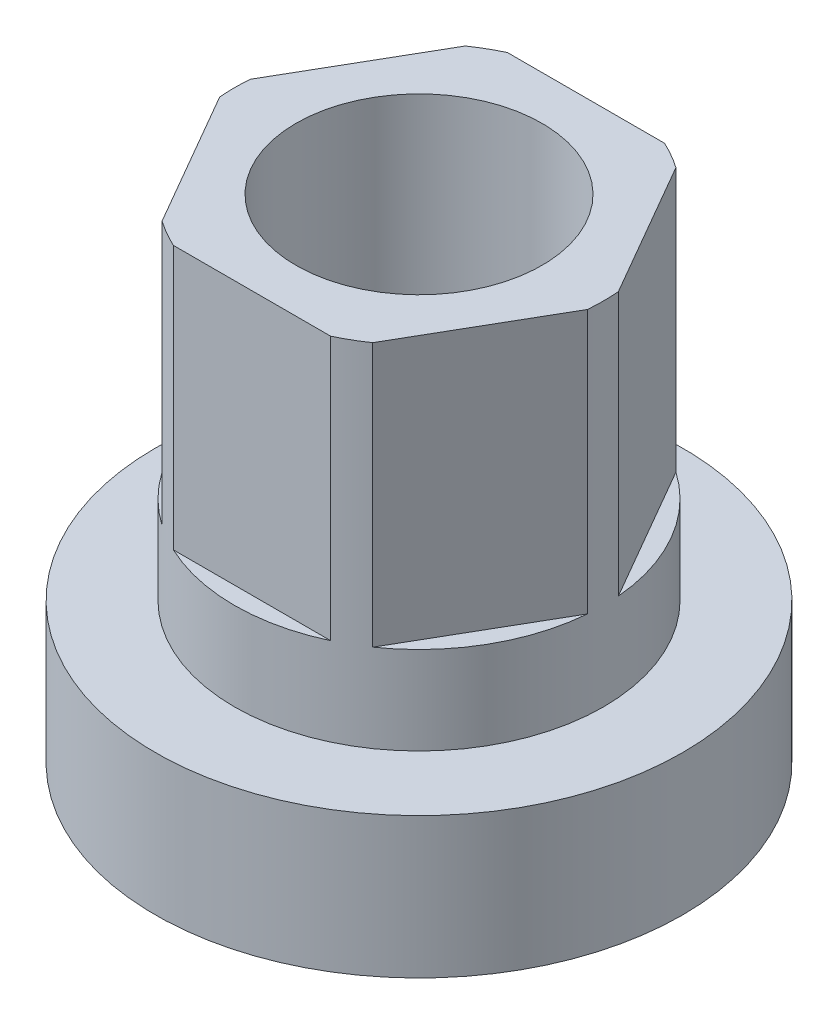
from build123d import *

# Parameters (mm, degrees)
ESQUISSE1_W             = 8
ESQUISSE1_H             = 28
ESQUISSE4_W             = 4.5
ESQUISSE4_H             = 20
ESQUISSE3_OUTSIDE_W     = 42.166
ESQUISSE3_OUTSIDE_H     = 42.166
ENL_V_MAT_EXTRU_1_DEPTH = 15


with BuildPart() as part:
    # Esquisse1 → R_volution1 (revolve)
    with BuildSketch(Plane.XY, mode=Mode.PRIVATE) as r_volution1_sk:
        with Locations((11, 14)):
            Rectangle(ESQUISSE1_W, ESQUISSE1_H)
    revolve(r_volution1_sk.sketch.rotate(Axis((0, 66.133233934, 0), (0, -1, 0)), 180), axis=Axis((0, 66.133233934, 0), (0, -1, 0)))

    # Esquisse4 → Enl_vement de mati_re-R_volution1 (revolve, cut)
    with BuildSketch(Plane.XY):
        with Locations((-12.75, 18)):
            Rectangle(ESQUISSE4_W, ESQUISSE4_H)
    revolve(axis=Axis((0, 43.648455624, 0), (0, -1, 0)), mode=Mode.SUBTRACT)

    # Esquisse3 outside → Enl_v. mat.-Extru.1 (cut)
    with BuildSketch(Plane(origin=(0, 28, 0), x_dir=(1, 0, 0), z_dir=(0, 1, 0))):
        Rectangle(ESQUISSE3_OUTSIDE_W, ESQUISSE3_OUTSIDE_H)
        Polygon((5.484827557, -9.5), (10.969655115, 0), (5.484827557, 9.5), (-5.484827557, 9.5), (-10.969655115, 0), (-5.484827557, -9.5), align=None, mode=Mode.SUBTRACT)
    extrude(amount=-ENL_V_MAT_EXTRU_1_DEPTH, mode=Mode.SUBTRACT)


solid = part.part
